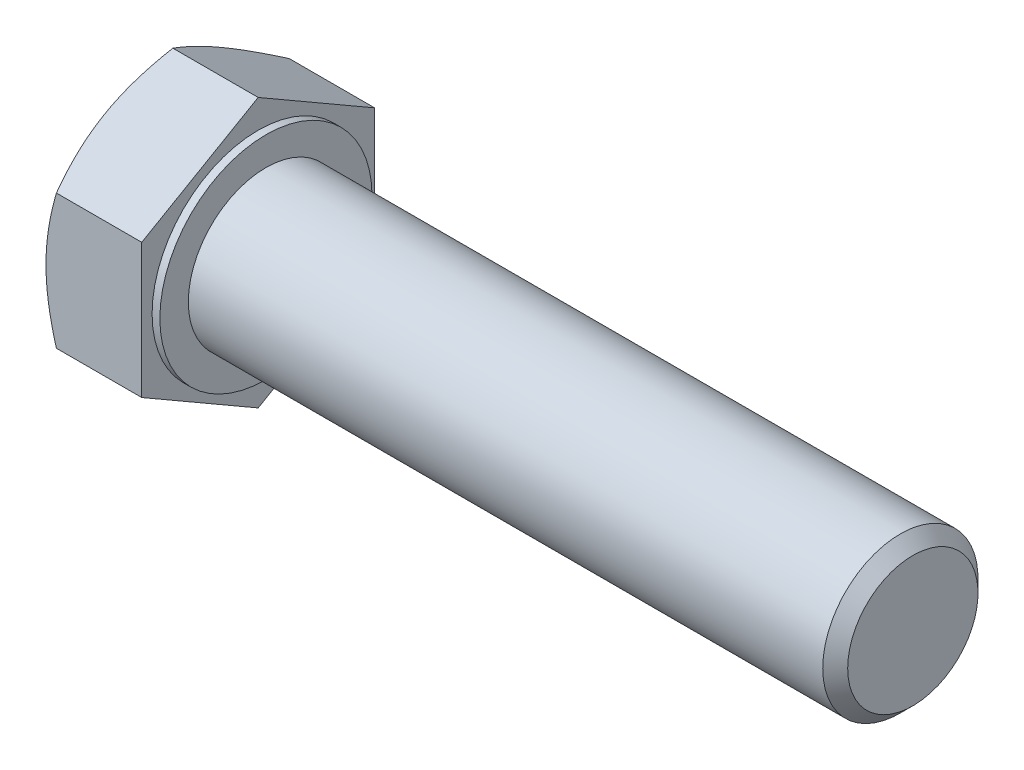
ISO-10303-21;
HEADER;
FILE_DESCRIPTION(('STEP AP214'),'2;1');
FILE_NAME('part.step','',(''),(''),'','','');
FILE_SCHEMA(('AUTOMOTIVE_DESIGN { 1 0 10303 214 1 1 1 1 }'));
ENDSEC;
DATA;
#1=APPLICATION_CONTEXT('core data for automotive mechanical design processes');
#2=APPLICATION_PROTOCOL_DEFINITION('international standard','automotive_design',2000,#1);
#3=PRODUCT_CONTEXT('',#1,'mechanical');
#4=PRODUCT('Part','Part','',(#3));
#5=PRODUCT_RELATED_PRODUCT_CATEGORY('part','',(#4));
#6=PRODUCT_DEFINITION_FORMATION('','',#4);
#7=PRODUCT_DEFINITION_CONTEXT('part definition',#1,'design');
#8=PRODUCT_DEFINITION('design','',#6,#7);
#9=PRODUCT_DEFINITION_SHAPE('','',#8);
#10=(LENGTH_UNIT() NAMED_UNIT(*) SI_UNIT(.MILLI.,.METRE.));
#11=(NAMED_UNIT(*) PLANE_ANGLE_UNIT() SI_UNIT($,.RADIAN.));
#12=(NAMED_UNIT(*) SI_UNIT($,.STERADIAN.) SOLID_ANGLE_UNIT());
#13=UNCERTAINTY_MEASURE_WITH_UNIT(LENGTH_MEASURE(1.E-05),#10,'distance_accuracy_value','');
#14=(GEOMETRIC_REPRESENTATION_CONTEXT(3) GLOBAL_UNCERTAINTY_ASSIGNED_CONTEXT((#13)) GLOBAL_UNIT_ASSIGNED_CONTEXT((#10,
#11,#12)) REPRESENTATION_CONTEXT('',''));
#15=CARTESIAN_POINT('',(0.,0.,0.));
#16=DIRECTION('',(0.,0.,1.));
#17=DIRECTION('',(1.,0.,0.));
#18=AXIS2_PLACEMENT_3D('',#15,#16,#17);
#19=CARTESIAN_POINT('',(8.,10.3923048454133,0.));
#20=DIRECTION('',(1.,0.,0.));
#21=DIRECTION('',(0.,0.,-1.));
#22=AXIS2_PLACEMENT_3D('',#19,#20,#21);
#23=PLANE('',#22);
#24=CARTESIAN_POINT('',(8.,0.,0.));
#25=DIRECTION('',(1.,0.,0.));
#26=DIRECTION('',(0.,0.,-1.));
#27=AXIS2_PLACEMENT_3D('',#24,#25,#26);
#28=CIRCLE('',#27,6.);
#29=CARTESIAN_POINT('',(8.,0.,-6.));
#30=VERTEX_POINT('',#29);
#31=EDGE_CURVE('E251',#30,#30,#28,.F.);
#32=ORIENTED_EDGE('',*,*,#31,.T.);
#33=EDGE_LOOP('',(#32));
#34=FACE_BOUND('',#33,.T.);
#35=CARTESIAN_POINT('',(8.,0.,0.));
#36=DIRECTION('',(-1.,0.,0.));
#37=DIRECTION('',(0.,0.,1.));
#38=AXIS2_PLACEMENT_3D('',#35,#36,#37);
#39=CIRCLE('',#38,8.2);
#40=CARTESIAN_POINT('',(8.,0.,8.2));
#41=VERTEX_POINT('',#40);
#42=EDGE_CURVE('E275',#41,#41,#39,.T.);
#43=ORIENTED_EDGE('',*,*,#42,.F.);
#44=EDGE_LOOP('',(#43));
#45=FACE_BOUND('',#44,.T.);
#46=ADVANCED_FACE('F32',(#34,#45),#23,.T.);
#47=CARTESIAN_POINT('',(0.,0.,0.));
#48=DIRECTION('',(-1.,0.,0.));
#49=DIRECTION('',(0.,0.,1.));
#50=AXIS2_PLACEMENT_3D('',#47,#48,#49);
#51=CYLINDRICAL_SURFACE('',#50,6.);
#52=ORIENTED_EDGE('',*,*,#31,.F.);
#53=EDGE_LOOP('',(#52));
#54=FACE_BOUND('',#53,.T.);
#55=CARTESIAN_POINT('',(57.036,0.,0.));
#56=DIRECTION('',(-1.,0.,0.));
#57=DIRECTION('',(0.,0.,1.));
#58=AXIS2_PLACEMENT_3D('',#55,#56,#57);
#59=CIRCLE('',#58,6.);
#60=CARTESIAN_POINT('',(57.036,0.,6.));
#61=VERTEX_POINT('',#60);
#62=EDGE_CURVE('E246',#61,#61,#59,.T.);
#63=ORIENTED_EDGE('',*,*,#62,.T.);
#64=EDGE_LOOP('',(#63));
#65=FACE_BOUND('',#64,.T.);
#66=ADVANCED_FACE('F232',(#54,#65),#51,.T.);
#67=CARTESIAN_POINT('',(58.,0.,0.));
#68=DIRECTION('',(-1.,0.,0.));
#69=DIRECTION('',(0.,0.,1.));
#70=AXIS2_PLACEMENT_3D('',#67,#68,#69);
#71=CONICAL_SURFACE('',#70,5.036,0.785398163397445);
#72=ORIENTED_EDGE('',*,*,#62,.F.);
#73=EDGE_LOOP('',(#72));
#74=FACE_BOUND('',#73,.T.);
#75=CARTESIAN_POINT('',(58.,0.,0.));
#76=DIRECTION('',(-1.,0.,0.));
#77=DIRECTION('',(0.,0.,1.));
#78=AXIS2_PLACEMENT_3D('',#75,#76,#77);
#79=CIRCLE('',#78,5.036);
#80=CARTESIAN_POINT('',(58.,0.,5.036));
#81=VERTEX_POINT('',#80);
#82=EDGE_CURVE('E249',#81,#81,#79,.T.);
#83=ORIENTED_EDGE('',*,*,#82,.T.);
#84=EDGE_LOOP('',(#83));
#85=FACE_BOUND('',#84,.T.);
#86=ADVANCED_FACE('F235',(#74,#85),#71,.T.);
#87=CARTESIAN_POINT('',(58.,0.,0.));
#88=DIRECTION('',(-1.,0.,0.));
#89=DIRECTION('',(0.,0.,1.));
#90=AXIS2_PLACEMENT_3D('',#87,#88,#89);
#91=PLANE('',#90);
#92=ORIENTED_EDGE('',*,*,#82,.F.);
#93=EDGE_LOOP('',(#92));
#94=FACE_BOUND('',#93,.T.);
#95=ADVANCED_FACE('F200',(#94),#91,.F.);
#96=CARTESIAN_POINT('',(7.4,8.2,0.));
#97=DIRECTION('',(1.,0.,0.));
#98=DIRECTION('',(0.,0.,-1.));
#99=AXIS2_PLACEMENT_3D('',#96,#97,#98);
#100=PLANE('',#99);
#101=CARTESIAN_POINT('',(7.4,0.,0.));
#102=DIRECTION('',(-1.,0.,0.));
#103=DIRECTION('',(0.,0.,1.));
#104=AXIS2_PLACEMENT_3D('',#101,#102,#103);
#105=CIRCLE('',#104,8.2);
#106=CARTESIAN_POINT('',(7.4,0.,8.2));
#107=VERTEX_POINT('',#106);
#108=EDGE_CURVE('E272',#107,#107,#105,.T.);
#109=ORIENTED_EDGE('',*,*,#108,.T.);
#110=EDGE_LOOP('',(#109));
#111=FACE_BOUND('',#110,.T.);
#112=DIRECTION('',(0.,0.500000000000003,0.866025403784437));
#113=VECTOR('',#112,1.);
#114=CARTESIAN_POINT('',(7.4,5.19615242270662,-9.));
#115=LINE('',#114,#113);
#116=CARTESIAN_POINT('',(7.4,5.19615242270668,-9.));
#117=VERTEX_POINT('',#116);
#118=CARTESIAN_POINT('',(7.4,10.3923048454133,0.));
#119=VERTEX_POINT('',#118);
#120=EDGE_CURVE('E109',#117,#119,#115,.T.);
#121=ORIENTED_EDGE('',*,*,#120,.T.);
#122=DIRECTION('',(0.,-0.500000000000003,0.866025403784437));
#123=VECTOR('',#122,1.);
#124=CARTESIAN_POINT('',(7.4,10.3923048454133,0.));
#125=LINE('',#124,#123);
#126=CARTESIAN_POINT('',(7.4,5.19615242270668,9.));
#127=VERTEX_POINT('',#126);
#128=EDGE_CURVE('E103',#119,#127,#125,.T.);
#129=ORIENTED_EDGE('',*,*,#128,.T.);
#130=DIRECTION('',(0.,-1.,0.));
#131=VECTOR('',#130,1.);
#132=CARTESIAN_POINT('',(7.4,5.19615242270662,9.));
#133=LINE('',#132,#131);
#134=CARTESIAN_POINT('',(7.4,-5.19615242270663,9.00000000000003));
#135=VERTEX_POINT('',#134);
#136=EDGE_CURVE('E106',#127,#135,#133,.T.);
#137=ORIENTED_EDGE('',*,*,#136,.T.);
#138=DIRECTION('',(0.,-0.500000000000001,-0.866025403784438));
#139=VECTOR('',#138,1.);
#140=CARTESIAN_POINT('',(7.4,-10.3923048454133,0.));
#141=LINE('',#140,#139);
#142=CARTESIAN_POINT('',(7.4,-10.3923048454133,0.));
#143=VERTEX_POINT('',#142);
#144=EDGE_CURVE('E122',#135,#143,#141,.T.);
#145=ORIENTED_EDGE('',*,*,#144,.T.);
#146=DIRECTION('',(0.,0.500000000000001,-0.866025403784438));
#147=VECTOR('',#146,1.);
#148=CARTESIAN_POINT('',(7.4,-5.19615242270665,-9.));
#149=LINE('',#148,#147);
#150=CARTESIAN_POINT('',(7.4,-5.19615242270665,-9.));
#151=VERTEX_POINT('',#150);
#152=EDGE_CURVE('E47',#143,#151,#149,.T.);
#153=ORIENTED_EDGE('',*,*,#152,.T.);
#154=DIRECTION('',(0.,1.,0.));
#155=VECTOR('',#154,1.);
#156=CARTESIAN_POINT('',(7.4,5.19615242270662,-9.));
#157=LINE('',#156,#155);
#158=EDGE_CURVE('E11',#151,#117,#157,.T.);
#159=ORIENTED_EDGE('',*,*,#158,.T.);
#160=EDGE_LOOP('',(#121,#129,#137,#145,#153,#159));
#161=FACE_BOUND('',#160,.T.);
#162=ADVANCED_FACE('F105',(#111,#161),#100,.T.);
#163=CARTESIAN_POINT('',(0.,0.,0.));
#164=DIRECTION('',(-1.,0.,0.));
#165=DIRECTION('',(0.,0.,1.));
#166=AXIS2_PLACEMENT_3D('',#163,#164,#165);
#167=CYLINDRICAL_SURFACE('',#166,8.2);
#168=ORIENTED_EDGE('',*,*,#42,.T.);
#169=EDGE_LOOP('',(#168));
#170=FACE_BOUND('',#169,.T.);
#171=ORIENTED_EDGE('',*,*,#108,.F.);
#172=EDGE_LOOP('',(#171));
#173=FACE_BOUND('',#172,.T.);
#174=ADVANCED_FACE('F229',(#170,#173),#167,.T.);
#175=CARTESIAN_POINT('',(0.,10.3923048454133,0.));
#176=DIRECTION('',(1.,0.,0.));
#177=DIRECTION('',(0.,0.,-1.));
#178=AXIS2_PLACEMENT_3D('',#175,#176,#177);
#179=PLANE('',#178);
#180=CARTESIAN_POINT('',(0.,0.,0.));
#181=DIRECTION('',(1.,0.,0.));
#182=DIRECTION('',(0.,0.,-1.));
#183=AXIS2_PLACEMENT_3D('',#180,#181,#182);
#184=CIRCLE('',#183,9.);
#185=CARTESIAN_POINT('',(0.,0.,-9.));
#186=VERTEX_POINT('',#185);
#187=CARTESIAN_POINT('',(0.,7.79422863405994,-4.50000000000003));
#188=VERTEX_POINT('',#187);
#189=EDGE_CURVE('E41',#186,#188,#184,.T.);
#190=ORIENTED_EDGE('',*,*,#189,.F.);
#191=CARTESIAN_POINT('',(0.,-7.79422863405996,-4.50000000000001));
#192=VERTEX_POINT('',#191);
#193=EDGE_CURVE('E130',#192,#186,#184,.T.);
#194=ORIENTED_EDGE('',*,*,#193,.F.);
#195=CARTESIAN_POINT('',(0.,-7.79422863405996,4.50000000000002));
#196=VERTEX_POINT('',#195);
#197=EDGE_CURVE('E136',#196,#192,#184,.T.);
#198=ORIENTED_EDGE('',*,*,#197,.F.);
#199=CARTESIAN_POINT('',(0.,0.,9.));
#200=VERTEX_POINT('',#199);
#201=EDGE_CURVE('E142',#200,#196,#184,.T.);
#202=ORIENTED_EDGE('',*,*,#201,.F.);
#203=CARTESIAN_POINT('',(0.,7.79422863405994,4.50000000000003));
#204=VERTEX_POINT('',#203);
#205=EDGE_CURVE('E147',#204,#200,#184,.T.);
#206=ORIENTED_EDGE('',*,*,#205,.F.);
#207=EDGE_CURVE('E143',#188,#204,#184,.T.);
#208=ORIENTED_EDGE('',*,*,#207,.F.);
#209=EDGE_LOOP('',(#190,#194,#198,#202,#206,#208));
#210=FACE_BOUND('',#209,.T.);
#211=ADVANCED_FACE('F161',(#210),#179,.F.);
#212=CARTESIAN_POINT('',(-2.25,0.,0.));
#213=DIRECTION('',(1.,0.,0.));
#214=DIRECTION('',(0.,0.,-1.));
#215=AXIS2_PLACEMENT_3D('',#212,#213,#214);
#216=CONICAL_SURFACE('',#215,5.10288568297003,1.0471975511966);
#217=CARTESIAN_POINT('',(0.803914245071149,10.3924203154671,0.000199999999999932));
#218=CARTESIAN_POINT('',(0.737982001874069,10.2782163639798,-0.197607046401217));
#219=CARTESIAN_POINT('',(0.675041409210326,10.1635669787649,-0.396185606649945));
#220=CARTESIAN_POINT('',(0.55596899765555,9.93333715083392,-0.79495536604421));
#221=CARTESIAN_POINT('',(0.499840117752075,9.81775632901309,-0.995147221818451));
#222=CARTESIAN_POINT('',(0.395151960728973,9.5854491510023,-1.3975150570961));
#223=CARTESIAN_POINT('',(0.346610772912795,9.46872074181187,-1.5996945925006));
#224=CARTESIAN_POINT('',(0.258148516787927,9.23447001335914,-2.00542875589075));
#225=CARTESIAN_POINT('',(0.21822568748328,9.11694786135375,-2.20898309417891));
#226=CARTESIAN_POINT('',(0.14868467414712,8.88408932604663,-2.61230590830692));
#227=CARTESIAN_POINT('',(0.118837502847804,8.76877014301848,-2.81204459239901));
#228=CARTESIAN_POINT('',(0.0687933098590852,8.53761579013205,-3.212415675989));
#229=CARTESIAN_POINT('',(0.0485954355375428,8.42178066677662,-3.41304799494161));
#230=CARTESIAN_POINT('',(0.0183543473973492,8.18990950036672,-3.81466063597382));
#231=CARTESIAN_POINT('',(0.00829960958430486,8.07387383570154,-4.01564030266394));
#232=CARTESIAN_POINT('',(-0.0014376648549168,7.84169571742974,-4.41778459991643));
#233=CARTESIAN_POINT('',(-0.0011205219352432,7.72555326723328,-4.61894922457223));
#234=CARTESIAN_POINT('',(0.00916395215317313,7.50842142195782,-4.99503261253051));
#235=CARTESIAN_POINT('',(0.0178767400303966,7.40741671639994,-5.1699778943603));
#236=CARTESIAN_POINT('',(0.0429773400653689,7.20564389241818,-5.51945867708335));
#237=CARTESIAN_POINT('',(0.0593656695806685,7.10487579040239,-5.69399414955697));
#238=CARTESIAN_POINT('',(0.119656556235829,6.80296159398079,-6.21692487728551));
#239=CARTESIAN_POINT('',(0.174677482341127,6.60234990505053,-6.56439451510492));
#240=CARTESIAN_POINT('',(0.312230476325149,6.1989985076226,-7.263019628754));
#241=CARTESIAN_POINT('',(0.395345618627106,5.99631027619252,-7.61408594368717));
#242=CARTESIAN_POINT('',(0.583982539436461,5.59395639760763,-8.31098330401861));
#243=CARTESIAN_POINT('',(0.689460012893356,5.39428559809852,-8.65682327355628));
#244=CARTESIAN_POINT('',(0.80391424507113,5.19603695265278,-9.0002));
#245=B_SPLINE_CURVE_WITH_KNOTS('',3,(#217,#218,#219,#220,#221,#222,#223,#224,#225,#226,#227,
#228,#229,#230,#231,#232,#233,#234,#235,#236,#237,#238,#239,#240,#241,#242,#243,#244),
.UNSPECIFIED.,.F.,.F.,(4,2,2,2,2,2,2,2,2,2,2,2,2,4),(0.,0.71321924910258,1.42674513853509,
2.14194697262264,2.85700253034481,3.55449749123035,4.25193080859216,4.94857085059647,
5.64518936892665,6.25162976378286,6.85811104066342,8.07193747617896,9.31268391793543,
10.5509947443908),.UNSPECIFIED.);
#246=CARTESIAN_POINT('',(0.803847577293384,10.3923048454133,0.));
#247=VERTEX_POINT('',#246);
#248=EDGE_CURVE('E55',#247,#188,#245,.T.);
#249=ORIENTED_EDGE('',*,*,#248,.T.);
#250=ORIENTED_EDGE('',*,*,#207,.T.);
#251=CARTESIAN_POINT('',(0.80391424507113,5.19603695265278,9.0002));
#252=CARTESIAN_POINT('',(0.737982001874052,5.31024090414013,8.80239295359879));
#253=CARTESIAN_POINT('',(0.67504140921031,5.42489028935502,8.60381439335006));
#254=CARTESIAN_POINT('',(0.555968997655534,5.65512011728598,8.20504463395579));
#255=CARTESIAN_POINT('',(0.499840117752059,5.77070093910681,8.00485277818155));
#256=CARTESIAN_POINT('',(0.395151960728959,6.00300811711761,7.6024849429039));
#257=CARTESIAN_POINT('',(0.346610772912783,6.11973652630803,7.40030540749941));
#258=CARTESIAN_POINT('',(0.258148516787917,6.35398725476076,6.99457124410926));
#259=CARTESIAN_POINT('',(0.218225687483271,6.47150940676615,6.79101690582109));
#260=CARTESIAN_POINT('',(0.148684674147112,6.70436794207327,6.38769409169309));
#261=CARTESIAN_POINT('',(0.118837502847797,6.81968712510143,6.187955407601));
#262=CARTESIAN_POINT('',(0.0687933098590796,7.05084147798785,5.78758432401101));
#263=CARTESIAN_POINT('',(0.0485954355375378,7.16667660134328,5.5869520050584));
#264=CARTESIAN_POINT('',(0.018354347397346,7.39854776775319,5.18533936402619));
#265=CARTESIAN_POINT('',(0.00829960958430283,7.51458343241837,4.98435969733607));
#266=CARTESIAN_POINT('',(-0.00143766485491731,7.74676155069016,4.58221540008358));
#267=CARTESIAN_POINT('',(-0.00112052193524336,7.86290400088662,4.38105077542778));
#268=CARTESIAN_POINT('',(0.00916395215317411,8.08003584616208,4.00496738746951));
#269=CARTESIAN_POINT('',(0.0178767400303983,8.18104055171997,3.83002210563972));
#270=CARTESIAN_POINT('',(0.0429773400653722,8.38281337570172,3.48054132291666));
#271=CARTESIAN_POINT('',(0.0593656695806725,8.48358147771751,3.30600585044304));
#272=CARTESIAN_POINT('',(0.119656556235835,8.78549567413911,2.7830751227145));
#273=CARTESIAN_POINT('',(0.174677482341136,8.98610736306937,2.43560548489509));
#274=CARTESIAN_POINT('',(0.312230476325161,9.38945876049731,1.736980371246));
#275=CARTESIAN_POINT('',(0.395345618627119,9.59214699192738,1.38591405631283));
#276=CARTESIAN_POINT('',(0.583982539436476,9.99450087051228,0.689016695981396));
#277=CARTESIAN_POINT('',(0.689460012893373,10.1941716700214,0.343176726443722));
#278=CARTESIAN_POINT('',(0.803914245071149,10.3924203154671,-0.00020000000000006));
#279=B_SPLINE_CURVE_WITH_KNOTS('',3,(#251,#252,#253,#254,#255,#256,#257,#258,#259,#260,#261,
#262,#263,#264,#265,#266,#267,#268,#269,#270,#271,#272,#273,#274,#275,#276,#277,#278),
.UNSPECIFIED.,.F.,.F.,(4,2,2,2,2,2,2,2,2,2,2,2,2,4),(0.,0.713219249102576,1.42674513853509,
2.14194697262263,2.85700253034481,3.55449749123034,4.25193080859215,4.94857085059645,
5.64518936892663,6.25162976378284,6.85811104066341,8.07193747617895,9.31268391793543,
10.5509947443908),.UNSPECIFIED.);
#280=EDGE_CURVE('E253',#204,#247,#279,.T.);
#281=ORIENTED_EDGE('',*,*,#280,.T.);
#282=EDGE_LOOP('',(#249,#250,#281));
#283=FACE_BOUND('',#282,.T.);
#284=ADVANCED_FACE('F192',(#283),#216,.T.);
#285=CARTESIAN_POINT('',(0.803847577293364,5.19615242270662,9.));
#286=VERTEX_POINT('',#285);
#287=EDGE_CURVE('E127',#286,#204,#279,.T.);
#288=ORIENTED_EDGE('',*,*,#287,.T.);
#289=ORIENTED_EDGE('',*,*,#205,.T.);
#290=CARTESIAN_POINT('',(4.40440242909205,-13.9825591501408,9.));
#291=CARTESIAN_POINT('',(4.21352027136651,-13.589267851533,9.));
#292=CARTESIAN_POINT('',(4.02446108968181,-13.1950764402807,9.));
#293=CARTESIAN_POINT('',(3.65101341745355,-12.4044148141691,9.));
#294=CARTESIAN_POINT('',(3.46662565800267,-12.0079442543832,9.));
#295=CARTESIAN_POINT('',(3.10262324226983,-11.2102149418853,9.));
#296=CARTESIAN_POINT('',(2.92303981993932,-10.8089418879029,9.));
#297=CARTESIAN_POINT('',(2.57118838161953,-10.0032131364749,9.));
#298=CARTESIAN_POINT('',(2.39892002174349,-9.5987575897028,9.));
#299=CARTESIAN_POINT('',(2.05819589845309,-8.77285037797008,9.));
#300=CARTESIAN_POINT('',(1.89004433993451,-8.35127251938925,9.));
#301=CARTESIAN_POINT('',(1.56640690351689,-7.50319485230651,9.));
#302=CARTESIAN_POINT('',(1.41092244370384,-7.07669449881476,9.));
#303=CARTESIAN_POINT('',(1.11668317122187,-6.21887842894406,9.));
#304=CARTESIAN_POINT('',(0.977894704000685,-5.78757438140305,9.));
#305=CARTESIAN_POINT('',(0.721482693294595,-4.91879467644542,9.));
#306=CARTESIAN_POINT('',(0.603852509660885,-4.48132100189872,9.));
#307=CARTESIAN_POINT('',(0.396022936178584,-3.60232451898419,9.));
#308=CARTESIAN_POINT('',(0.305673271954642,-3.16083822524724,9.));
#309=CARTESIAN_POINT('',(0.194505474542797,-2.49456832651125,9.));
#310=CARTESIAN_POINT('',(0.161507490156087,-2.27178873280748,9.));
#311=CARTESIAN_POINT('',(0.104277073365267,-1.82511370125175,9.));
#312=CARTESIAN_POINT('',(0.0800437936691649,-1.60121837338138,9.));
#313=CARTESIAN_POINT('',(0.0411307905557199,-1.15554740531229,9.));
#314=CARTESIAN_POINT('',(0.0263302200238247,-0.933782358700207,9.));
#315=CARTESIAN_POINT('',(0.00612165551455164,-0.48982505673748,9.));
#316=CARTESIAN_POINT('',(0.000713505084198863,-0.267632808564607,9.));
#317=CARTESIAN_POINT('',(-0.000581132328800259,0.176781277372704,9.));
#318=CARTESIAN_POINT('',(0.00353239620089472,0.399003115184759,9.));
#319=CARTESIAN_POINT('',(0.0211802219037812,0.843075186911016,9.));
#320=CARTESIAN_POINT('',(0.0347149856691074,1.06492540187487,9.));
#321=CARTESIAN_POINT('',(0.0782159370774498,1.59735185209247,9.));
#322=CARTESIAN_POINT('',(0.112610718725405,1.90757395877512,9.));
#323=CARTESIAN_POINT('',(0.197951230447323,2.52571747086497,9.));
#324=CARTESIAN_POINT('',(0.248899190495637,2.83363856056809,9.));
#325=CARTESIAN_POINT('',(0.423871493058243,3.75359836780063,9.));
#326=CARTESIAN_POINT('',(0.569992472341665,4.36149011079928,9.));
#327=CARTESIAN_POINT('',(0.823402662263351,5.27045401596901,9.));
#328=CARTESIAN_POINT('',(0.91475427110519,5.5762406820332,9.));
#329=CARTESIAN_POINT('',(1.1069533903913,6.18484428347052,9.));
#330=CARTESIAN_POINT('',(1.20780096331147,6.48766119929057,9.));
#331=CARTESIAN_POINT('',(1.41737334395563,7.09042005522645,9.));
#332=CARTESIAN_POINT('',(1.52609555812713,7.39036290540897,9.));
#333=CARTESIAN_POINT('',(1.75013726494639,7.98776331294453,9.));
#334=CARTESIAN_POINT('',(1.86545668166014,8.28522089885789,9.));
#335=CARTESIAN_POINT('',(2.14416312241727,8.98476295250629,9.));
#336=CARTESIAN_POINT('',(2.30989301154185,9.38591223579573,9.));
#337=CARTESIAN_POINT('',(2.64938307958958,10.1848085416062,9.));
#338=CARTESIAN_POINT('',(2.82314374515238,10.5825553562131,9.));
#339=CARTESIAN_POINT('',(3.17709432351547,11.3752767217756,9.));
#340=CARTESIAN_POINT('',(3.35728566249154,11.7702506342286,9.));
#341=CARTESIAN_POINT('',(3.72280622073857,12.557797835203,9.));
#342=CARTESIAN_POINT('',(3.9081353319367,12.9503711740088,9.));
#343=CARTESIAN_POINT('',(4.28317774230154,13.7339419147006,9.));
#344=CARTESIAN_POINT('',(4.47289561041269,14.1249371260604,9.));
#345=CARTESIAN_POINT('',(4.85577768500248,14.9052357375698,9.));
#346=CARTESIAN_POINT('',(5.04894190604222,15.2945391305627,9.));
#347=CARTESIAN_POINT('',(5.63264129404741,16.4602147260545,9.));
#348=CARTESIAN_POINT('',(6.02743288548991,17.2344553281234,9.));
#349=CARTESIAN_POINT('',(6.79169790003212,18.7143023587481,9.));
#350=CARTESIAN_POINT('',(7.16053205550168,19.4202404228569,9.));
#351=CARTESIAN_POINT('',(7.90326698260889,20.8294760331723,9.));
#352=CARTESIAN_POINT('',(8.27716793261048,21.5327734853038,9.));
#353=CARTESIAN_POINT('',(9.02789155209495,22.9355520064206,9.));
#354=CARTESIAN_POINT('',(9.40470462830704,23.6350382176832,9.));
#355=CARTESIAN_POINT('',(10.1613606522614,25.0323206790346,9.));
#356=CARTESIAN_POINT('',(10.5412034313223,25.7301170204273,9.));
#357=CARTESIAN_POINT('',(10.922177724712,26.427290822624,9.));
#358=B_SPLINE_CURVE_WITH_KNOTS('',3,(#290,#291,#292,#293,#294,#295,#296,#297,#298,#299,#300,
#301,#302,#303,#304,#305,#306,#307,#308,#309,#310,#311,#312,#313,#314,#315,#316,#317,#318,#319,
#320,#321,#322,#323,#324,#325,#326,#327,#328,#329,#330,#331,#332,#333,#334,#335,#336,#337,#338,
#339,#340,#341,#342,#343,#344,#345,#346,#347,#348,#349,#350,#351,#352,#353,#354,#355,#356,#357),
.UNSPECIFIED.,.F.,.F.,(4,2,2,2,2,2,2,2,2,2,2,2,2,2,2,2,2,2,2,2,2,2,2,2,2,2,2,2,2,2,2,2,2,4),(0.,
1.31151365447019,2.62323131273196,3.94204822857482,5.2608030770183,6.62227116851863,
7.98389146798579,9.34271941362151,10.7011201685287,12.0518956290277,12.7273808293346,
13.402800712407,14.0693836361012,14.7359554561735,15.402528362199,16.0691342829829,
17.0049748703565,17.9409415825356,19.8139052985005,20.7712463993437,21.7285937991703,
22.6856273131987,23.6426498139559,24.9446398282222,26.2467088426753,27.5490684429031,
28.8514006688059,30.1551558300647,31.458916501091,34.0660948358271,36.4555257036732,
38.8450409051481,41.2286062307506,43.6120397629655),.UNSPECIFIED.);
#359=EDGE_CURVE('E171',#200,#286,#358,.T.);
#360=ORIENTED_EDGE('',*,*,#359,.T.);
#361=EDGE_LOOP('',(#288,#289,#360));
#362=FACE_BOUND('',#361,.T.);
#363=ADVANCED_FACE('F197',(#362),#216,.T.);
#364=CARTESIAN_POINT('',(0.803847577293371,-5.19615242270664,9.));
#365=VERTEX_POINT('',#364);
#366=EDGE_CURVE('E159',#365,#200,#358,.T.);
#367=ORIENTED_EDGE('',*,*,#366,.T.);
#368=ORIENTED_EDGE('',*,*,#201,.T.);
#369=CARTESIAN_POINT('',(0.803914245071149,-10.3924203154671,-0.000200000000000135));
#370=CARTESIAN_POINT('',(0.73798200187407,-10.2782163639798,0.197607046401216));
#371=CARTESIAN_POINT('',(0.675041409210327,-10.1635669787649,0.396185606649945));
#372=CARTESIAN_POINT('',(0.555968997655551,-9.93333715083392,0.794955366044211));
#373=CARTESIAN_POINT('',(0.499840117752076,-9.8177563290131,0.995147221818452));
#374=CARTESIAN_POINT('',(0.395151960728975,-9.5854491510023,1.3975150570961));
#375=CARTESIAN_POINT('',(0.346610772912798,-9.46872074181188,1.5996945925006));
#376=CARTESIAN_POINT('',(0.25814851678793,-9.23447001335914,2.00542875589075));
#377=CARTESIAN_POINT('',(0.218225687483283,-9.11694786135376,2.20898309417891));
#378=CARTESIAN_POINT('',(0.148684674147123,-8.88408932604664,2.61230590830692));
#379=CARTESIAN_POINT('',(0.118837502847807,-8.76877014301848,2.81204459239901));
#380=CARTESIAN_POINT('',(0.0687933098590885,-8.53761579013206,3.212415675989));
#381=CARTESIAN_POINT('',(0.0485954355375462,-8.42178066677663,3.41304799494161));
#382=CARTESIAN_POINT('',(0.0183543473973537,-8.18990950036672,3.81466063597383));
#383=CARTESIAN_POINT('',(0.00829960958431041,-8.07387383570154,4.01564030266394));
#384=CARTESIAN_POINT('',(-0.00143766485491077,-7.84169571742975,4.41778459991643));
#385=CARTESIAN_POINT('',(-0.00112052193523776,-7.72555326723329,4.61894922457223));
#386=CARTESIAN_POINT('',(0.00916395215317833,-7.50842142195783,4.99503261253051));
#387=CARTESIAN_POINT('',(0.017876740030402,-7.40741671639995,5.1699778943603));
#388=CARTESIAN_POINT('',(0.0429773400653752,-7.20564389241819,5.51945867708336));
#389=CARTESIAN_POINT('',(0.0593656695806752,-7.1048757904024,5.69399414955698));
#390=CARTESIAN_POINT('',(0.119656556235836,-6.80296159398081,6.21692487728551));
#391=CARTESIAN_POINT('',(0.174677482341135,-6.60234990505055,6.56439451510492));
#392=CARTESIAN_POINT('',(0.312230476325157,-6.19899850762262,7.263019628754));
#393=CARTESIAN_POINT('',(0.395345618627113,-5.99631027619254,7.61408594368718));
#394=CARTESIAN_POINT('',(0.583982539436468,-5.59395639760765,8.31098330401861));
#395=CARTESIAN_POINT('',(0.689460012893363,-5.39428559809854,8.65682327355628));
#396=CARTESIAN_POINT('',(0.803914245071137,-5.1960369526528,9.0002));
#397=B_SPLINE_CURVE_WITH_KNOTS('',3,(#369,#370,#371,#372,#373,#374,#375,#376,#377,#378,#379,
#380,#381,#382,#383,#384,#385,#386,#387,#388,#389,#390,#391,#392,#393,#394,#395,#396),
.UNSPECIFIED.,.F.,.F.,(4,2,2,2,2,2,2,2,2,2,2,2,2,4),(0.,0.71321924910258,1.42674513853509,
2.14194697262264,2.85700253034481,3.55449749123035,4.25193080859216,4.94857085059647,
5.64518936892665,6.25162976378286,6.85811104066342,8.07193747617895,9.31268391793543,
10.5509947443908),.UNSPECIFIED.);
#398=EDGE_CURVE('E158',#196,#365,#397,.T.);
#399=ORIENTED_EDGE('',*,*,#398,.T.);
#400=EDGE_LOOP('',(#367,#368,#399));
#401=FACE_BOUND('',#400,.T.);
#402=ADVANCED_FACE('F156',(#401),#216,.T.);
#403=CARTESIAN_POINT('',(0.803847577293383,-10.3923048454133,0.));
#404=VERTEX_POINT('',#403);
#405=EDGE_CURVE('E169',#404,#196,#397,.T.);
#406=ORIENTED_EDGE('',*,*,#405,.T.);
#407=ORIENTED_EDGE('',*,*,#197,.T.);
#408=CARTESIAN_POINT('',(0.80391424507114,-5.19603695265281,-9.0002));
#409=CARTESIAN_POINT('',(0.737982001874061,-5.31024090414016,-8.80239295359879));
#410=CARTESIAN_POINT('',(0.675041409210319,-5.42489028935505,-8.60381439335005));
#411=CARTESIAN_POINT('',(0.555968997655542,-5.65512011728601,-8.20504463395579));
#412=CARTESIAN_POINT('',(0.499840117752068,-5.77070093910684,-8.00485277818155));
#413=CARTESIAN_POINT('',(0.395151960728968,-6.00300811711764,-7.6024849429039));
#414=CARTESIAN_POINT('',(0.346610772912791,-6.11973652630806,-7.4003054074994));
#415=CARTESIAN_POINT('',(0.258148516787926,-6.35398725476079,-6.99457124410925));
#416=CARTESIAN_POINT('',(0.218225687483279,-6.47150940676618,-6.79101690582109));
#417=CARTESIAN_POINT('',(0.14868467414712,-6.7043679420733,-6.38769409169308));
#418=CARTESIAN_POINT('',(0.118837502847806,-6.81968712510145,-6.18795540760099));
#419=CARTESIAN_POINT('',(0.0687933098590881,-7.05084147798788,-5.787584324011));
#420=CARTESIAN_POINT('',(0.0485954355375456,-7.1666766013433,-5.58695200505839));
#421=CARTESIAN_POINT('',(0.0183543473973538,-7.39854776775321,-5.18533936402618));
#422=CARTESIAN_POINT('',(0.00829960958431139,-7.51458343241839,-4.98435969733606));
#423=CARTESIAN_POINT('',(-0.00143766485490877,-7.74676155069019,-4.58221540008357));
#424=CARTESIAN_POINT('',(-0.00112052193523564,-7.86290400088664,-4.38105077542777));
#425=CARTESIAN_POINT('',(0.00916395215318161,-8.0800358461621,-4.00496738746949));
#426=CARTESIAN_POINT('',(0.0178767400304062,-8.18104055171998,-3.8300221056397));
#427=CARTESIAN_POINT('',(0.0429773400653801,-8.38281337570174,-3.48054132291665));
#428=CARTESIAN_POINT('',(0.0593656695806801,-8.48358147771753,-3.30600585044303));
#429=CARTESIAN_POINT('',(0.119656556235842,-8.78549567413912,-2.78307512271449));
#430=CARTESIAN_POINT('',(0.174677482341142,-8.98610736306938,-2.43560548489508));
#431=CARTESIAN_POINT('',(0.312230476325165,-9.38945876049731,-1.736980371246));
#432=CARTESIAN_POINT('',(0.395345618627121,-9.59214699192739,-1.38591405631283));
#433=CARTESIAN_POINT('',(0.583982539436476,-9.99450087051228,-0.689016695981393));
#434=CARTESIAN_POINT('',(0.689460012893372,-10.1941716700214,-0.343176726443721));
#435=CARTESIAN_POINT('',(0.803914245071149,-10.3924203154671,0.000199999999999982));
#436=B_SPLINE_CURVE_WITH_KNOTS('',3,(#408,#409,#410,#411,#412,#413,#414,#415,#416,#417,#418,
#419,#420,#421,#422,#423,#424,#425,#426,#427,#428,#429,#430,#431,#432,#433,#434,#435),
.UNSPECIFIED.,.F.,.F.,(4,2,2,2,2,2,2,2,2,2,2,2,2,4),(0.,0.713219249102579,1.42674513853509,
2.14194697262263,2.85700253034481,3.55449749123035,4.25193080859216,4.94857085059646,
5.64518936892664,6.25162976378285,6.85811104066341,8.07193747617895,9.31268391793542,
10.5509947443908),.UNSPECIFIED.);
#437=EDGE_CURVE('E173',#192,#404,#436,.T.);
#438=ORIENTED_EDGE('',*,*,#437,.T.);
#439=EDGE_LOOP('',(#406,#407,#438));
#440=FACE_BOUND('',#439,.T.);
#441=ADVANCED_FACE('F265',(#440),#216,.T.);
#442=CARTESIAN_POINT('',(4.40440242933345,-13.982559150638,-9.00000000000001));
#443=CARTESIAN_POINT('',(4.21352027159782,-13.5892678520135,-9.));
#444=CARTESIAN_POINT('',(4.02446108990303,-13.1950764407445,-9.));
#445=CARTESIAN_POINT('',(3.65101341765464,-12.4044148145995,-9.));
#446=CARTESIAN_POINT('',(3.46662565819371,-12.0079442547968,-9.));
#447=CARTESIAN_POINT('',(3.10262324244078,-11.2102149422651,-9.));
#448=CARTESIAN_POINT('',(2.92303982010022,-10.8089418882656,-9.));
#449=CARTESIAN_POINT('',(2.5711883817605,-10.0032131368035,-9.));
#450=CARTESIAN_POINT('',(2.39892002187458,-9.5987575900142,-9.));
#451=CARTESIAN_POINT('',(2.05819589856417,-8.77285037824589,-9.));
#452=CARTESIAN_POINT('',(1.89004434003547,-8.35127251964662,-9.));
#453=CARTESIAN_POINT('',(1.56640690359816,-7.50319485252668,-9.));
#454=CARTESIAN_POINT('',(1.41092244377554,-7.07669449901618,-9.));
#455=CARTESIAN_POINT('',(1.11668317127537,-6.21887842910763,-9.));
#456=CARTESIAN_POINT('',(0.977894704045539,-5.78757438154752,-9.));
#457=CARTESIAN_POINT('',(0.721482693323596,-4.91879467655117,-9.));
#458=CARTESIAN_POINT('',(0.603852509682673,-4.48132100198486,-9.));
#459=CARTESIAN_POINT('',(0.39602293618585,-3.60232451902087,-9.));
#460=CARTESIAN_POINT('',(0.305673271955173,-3.16083822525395,-9.));
#461=CARTESIAN_POINT('',(0.194505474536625,-2.49456832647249,-9.));
#462=CARTESIAN_POINT('',(0.161507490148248,-2.27178873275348,-9.));
#463=CARTESIAN_POINT('',(0.104277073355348,-1.82511370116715,-9.));
#464=CARTESIAN_POINT('',(0.0800437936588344,-1.60121837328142,-9.));
#465=CARTESIAN_POINT('',(0.0411307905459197,-1.15554740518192,-9.));
#466=CARTESIAN_POINT('',(0.0263302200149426,-0.933782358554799,-9.));
#467=CARTESIAN_POINT('',(0.00612165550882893,-0.489825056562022,-9.));
#468=CARTESIAN_POINT('',(0.000713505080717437,-0.267632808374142,-9.));
#469=CARTESIAN_POINT('',(-0.000581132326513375,0.176781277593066,-9.));
#470=CARTESIAN_POINT('',(0.00353239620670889,0.399003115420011,-9.));
#471=CARTESIAN_POINT('',(0.021180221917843,0.843075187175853,-9.));
#472=CARTESIAN_POINT('',(0.0347149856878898,1.0649254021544,-9.));
#473=CARTESIAN_POINT('',(0.07821593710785,1.59735185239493,-9.));
#474=CARTESIAN_POINT('',(0.112610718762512,1.90757395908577,-9.));
#475=CARTESIAN_POINT('',(0.197951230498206,2.5257174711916,-9.));
#476=CARTESIAN_POINT('',(0.248899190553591,2.83363856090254,-9.));
#477=CARTESIAN_POINT('',(0.423871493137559,3.75359836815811,-9.));
#478=CARTESIAN_POINT('',(0.569992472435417,4.36149011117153,-9.));
#479=CARTESIAN_POINT('',(0.823402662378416,5.27045401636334,-9.));
#480=CARTESIAN_POINT('',(0.914754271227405,5.57624068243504,-9.));
#481=CARTESIAN_POINT('',(1.10695339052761,6.18484428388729,-9.));
#482=CARTESIAN_POINT('',(1.20780096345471,6.48766119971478,-9.));
#483=CARTESIAN_POINT('',(1.41737334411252,7.09042005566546,-9.));
#484=CARTESIAN_POINT('',(1.52609555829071,7.39036290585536,-9.));
#485=CARTESIAN_POINT('',(1.75013726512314,7.98776331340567,-9.));
#486=CARTESIAN_POINT('',(1.86545668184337,8.28522089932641,-9.));
#487=CARTESIAN_POINT('',(2.14416312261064,8.98476295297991,-9.));
#488=CARTESIAN_POINT('',(2.30989301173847,9.38591223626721,-9.));
#489=CARTESIAN_POINT('',(2.64938307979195,10.1848085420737,-9.));
#490=CARTESIAN_POINT('',(2.82314374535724,10.5825553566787,-9.));
#491=CARTESIAN_POINT('',(3.17709432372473,11.3752767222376,-9.));
#492=CARTESIAN_POINT('',(3.35728566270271,11.7702506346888,-9.));
#493=CARTESIAN_POINT('',(3.72280622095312,12.5577978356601,-9.));
#494=CARTESIAN_POINT('',(3.90813533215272,12.9503711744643,-8.99999999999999));
#495=CARTESIAN_POINT('',(4.28317774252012,13.7339419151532,-8.99999999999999));
#496=CARTESIAN_POINT('',(4.47289561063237,14.1249371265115,-8.99999999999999));
#497=CARTESIAN_POINT('',(4.85577768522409,14.9052357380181,-8.99999999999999));
#498=CARTESIAN_POINT('',(5.04894190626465,15.2945391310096,-8.99999999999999));
#499=CARTESIAN_POINT('',(5.63264129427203,16.4602147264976,-8.99999999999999));
#500=CARTESIAN_POINT('',(6.02743288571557,17.2344553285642,-8.99999999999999));
#501=CARTESIAN_POINT('',(6.79169790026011,18.7143023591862,-8.99999999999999));
#502=CARTESIAN_POINT('',(7.160532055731,19.4202404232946,-8.99999999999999));
#503=CARTESIAN_POINT('',(7.9032669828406,20.8294760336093,-8.99999999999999));
#504=CARTESIAN_POINT('',(8.27716793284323,21.5327734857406,-8.99999999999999));
#505=CARTESIAN_POINT('',(9.02789155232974,22.9355520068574,-8.99999999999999));
#506=CARTESIAN_POINT('',(9.40470462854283,23.6350382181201,-8.99999999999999));
#507=CARTESIAN_POINT('',(10.161360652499,25.032320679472,-8.99999999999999));
#508=CARTESIAN_POINT('',(10.5412034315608,25.7301170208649,-8.99999999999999));
#509=CARTESIAN_POINT('',(10.9221777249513,26.4272908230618,-8.99999999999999));
#510=B_SPLINE_CURVE_WITH_KNOTS('',3,(#442,#443,#444,#445,#446,#447,#448,#449,#450,#451,#452,
#453,#454,#455,#456,#457,#458,#459,#460,#461,#462,#463,#464,#465,#466,#467,#468,#469,#470,#471,
#472,#473,#474,#475,#476,#477,#478,#479,#480,#481,#482,#483,#484,#485,#486,#487,#488,#489,#490,
#491,#492,#493,#494,#495,#496,#497,#498,#499,#500,#501,#502,#503,#504,#505,#506,#507,#508,#509),
.UNSPECIFIED.,.F.,.F.,(4,2,2,2,2,2,2,2,2,2,2,2,2,2,2,2,2,2,2,2,2,2,2,2,2,2,2,2,2,2,2,2,2,4),(0.,
1.3115136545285,2.62323131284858,3.94204822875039,5.26080307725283,6.6222711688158,
7.98389146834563,9.34271941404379,10.7011201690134,12.0518956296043,12.7273808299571,
13.4028007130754,14.0693836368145,14.7359554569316,15.4025283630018,16.0691342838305,
17.0049748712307,17.9409415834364,19.8139052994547,20.7712464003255,21.7285938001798,
22.6856273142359,23.6426498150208,24.944639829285,26.2467088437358,27.5490684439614,
28.8514006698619,30.1551558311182,31.4589165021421,34.0660948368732,36.4555257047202,
38.845040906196,41.2286062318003,43.6120397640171),.UNSPECIFIED.);
#511=CARTESIAN_POINT('',(0.803847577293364,5.19615242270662,-9.));
#512=VERTEX_POINT('',#511);
#513=EDGE_CURVE('E266',#512,#186,#510,.F.);
#514=ORIENTED_EDGE('',*,*,#513,.T.);
#515=ORIENTED_EDGE('',*,*,#189,.T.);
#516=EDGE_CURVE('E180',#188,#512,#245,.T.);
#517=ORIENTED_EDGE('',*,*,#516,.T.);
#518=EDGE_LOOP('',(#514,#515,#517));
#519=FACE_BOUND('',#518,.T.);
#520=ADVANCED_FACE('F320',(#519),#216,.T.);
#521=CARTESIAN_POINT('',(0.803847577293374,-5.19615242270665,-9.));
#522=VERTEX_POINT('',#521);
#523=EDGE_CURVE('E213',#522,#192,#436,.T.);
#524=ORIENTED_EDGE('',*,*,#523,.T.);
#525=ORIENTED_EDGE('',*,*,#193,.T.);
#526=EDGE_CURVE('E205',#186,#522,#510,.F.);
#527=ORIENTED_EDGE('',*,*,#526,.T.);
#528=EDGE_LOOP('',(#524,#525,#527));
#529=FACE_BOUND('',#528,.T.);
#530=ADVANCED_FACE('F198',(#529),#216,.T.);
#531=CARTESIAN_POINT('',(8.,5.19615242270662,-9.));
#532=DIRECTION('',(0.,0.,1.));
#533=DIRECTION('',(0.,-1.,0.));
#534=AXIS2_PLACEMENT_3D('',#531,#532,#533);
#535=PLANE('',#534);
#536=ORIENTED_EDGE('',*,*,#158,.F.);
#537=DIRECTION('',(-1.,0.,0.));
#538=VECTOR('',#537,1.);
#539=CARTESIAN_POINT('',(8.,-5.19615242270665,-9.));
#540=LINE('',#539,#538);
#541=EDGE_CURVE('E262',#151,#522,#540,.T.);
#542=ORIENTED_EDGE('',*,*,#541,.T.);
#543=ORIENTED_EDGE('',*,*,#526,.F.);
#544=ORIENTED_EDGE('',*,*,#513,.F.);
#545=DIRECTION('',(-1.,0.,0.));
#546=VECTOR('',#545,1.);
#547=CARTESIAN_POINT('',(8.,5.19615242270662,-9.));
#548=LINE('',#547,#546);
#549=EDGE_CURVE('E260',#117,#512,#548,.T.);
#550=ORIENTED_EDGE('',*,*,#549,.F.);
#551=EDGE_LOOP('',(#536,#542,#543,#544,#550));
#552=FACE_BOUND('',#551,.T.);
#553=ADVANCED_FACE('F221',(#552),#535,.F.);
#554=CARTESIAN_POINT('',(8.,-5.19615242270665,-9.));
#555=DIRECTION('',(0.,0.866025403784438,0.500000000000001));
#556=DIRECTION('',(0.,-0.500000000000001,0.866025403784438));
#557=AXIS2_PLACEMENT_3D('',#554,#555,#556);
#558=PLANE('',#557);
#559=ORIENTED_EDGE('',*,*,#152,.F.);
#560=DIRECTION('',(-1.,0.,0.));
#561=VECTOR('',#560,1.);
#562=CARTESIAN_POINT('',(8.,-10.3923048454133,0.));
#563=LINE('',#562,#561);
#564=EDGE_CURVE('E132',#143,#404,#563,.T.);
#565=ORIENTED_EDGE('',*,*,#564,.T.);
#566=ORIENTED_EDGE('',*,*,#437,.F.);
#567=ORIENTED_EDGE('',*,*,#523,.F.);
#568=ORIENTED_EDGE('',*,*,#541,.F.);
#569=EDGE_LOOP('',(#559,#565,#566,#567,#568));
#570=FACE_BOUND('',#569,.T.);
#571=ADVANCED_FACE('F218',(#570),#558,.F.);
#572=CARTESIAN_POINT('',(8.,-10.3923048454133,0.));
#573=DIRECTION('',(0.,0.866025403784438,-0.500000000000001));
#574=DIRECTION('',(0.,0.500000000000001,0.866025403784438));
#575=AXIS2_PLACEMENT_3D('',#572,#573,#574);
#576=PLANE('',#575);
#577=ORIENTED_EDGE('',*,*,#144,.F.);
#578=DIRECTION('',(-1.,0.,0.));
#579=VECTOR('',#578,1.);
#580=CARTESIAN_POINT('',(8.,-5.19615242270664,9.));
#581=LINE('',#580,#579);
#582=EDGE_CURVE('E121',#135,#365,#581,.T.);
#583=ORIENTED_EDGE('',*,*,#582,.T.);
#584=ORIENTED_EDGE('',*,*,#398,.F.);
#585=ORIENTED_EDGE('',*,*,#405,.F.);
#586=ORIENTED_EDGE('',*,*,#564,.F.);
#587=EDGE_LOOP('',(#577,#583,#584,#585,#586));
#588=FACE_BOUND('',#587,.T.);
#589=ADVANCED_FACE('F167',(#588),#576,.F.);
#590=CARTESIAN_POINT('',(8.,5.19615242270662,9.));
#591=DIRECTION('',(0.,0.,-1.));
#592=DIRECTION('',(0.,1.,0.));
#593=AXIS2_PLACEMENT_3D('',#590,#591,#592);
#594=PLANE('',#593);
#595=ORIENTED_EDGE('',*,*,#136,.F.);
#596=DIRECTION('',(-1.,0.,0.));
#597=VECTOR('',#596,1.);
#598=CARTESIAN_POINT('',(8.,5.19615242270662,9.));
#599=LINE('',#598,#597);
#600=EDGE_CURVE('E118',#127,#286,#599,.T.);
#601=ORIENTED_EDGE('',*,*,#600,.T.);
#602=ORIENTED_EDGE('',*,*,#359,.F.);
#603=ORIENTED_EDGE('',*,*,#366,.F.);
#604=ORIENTED_EDGE('',*,*,#582,.F.);
#605=EDGE_LOOP('',(#595,#601,#602,#603,#604));
#606=FACE_BOUND('',#605,.T.);
#607=ADVANCED_FACE('F116',(#606),#594,.F.);
#608=CARTESIAN_POINT('',(8.,10.3923048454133,0.));
#609=DIRECTION('',(0.,-0.866025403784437,-0.500000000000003));
#610=DIRECTION('',(0.,0.500000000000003,-0.866025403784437));
#611=AXIS2_PLACEMENT_3D('',#608,#609,#610);
#612=PLANE('',#611);
#613=ORIENTED_EDGE('',*,*,#128,.F.);
#614=DIRECTION('',(-1.,0.,0.));
#615=VECTOR('',#614,1.);
#616=CARTESIAN_POINT('',(8.,10.3923048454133,0.));
#617=LINE('',#616,#615);
#618=EDGE_CURVE('E128',#119,#247,#617,.T.);
#619=ORIENTED_EDGE('',*,*,#618,.T.);
#620=ORIENTED_EDGE('',*,*,#280,.F.);
#621=ORIENTED_EDGE('',*,*,#287,.F.);
#622=ORIENTED_EDGE('',*,*,#600,.F.);
#623=EDGE_LOOP('',(#613,#619,#620,#621,#622));
#624=FACE_BOUND('',#623,.T.);
#625=ADVANCED_FACE('F125',(#624),#612,.F.);
#626=CARTESIAN_POINT('',(8.,5.19615242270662,-9.));
#627=DIRECTION('',(0.,-0.866025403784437,0.500000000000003));
#628=DIRECTION('',(0.,-0.500000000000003,-0.866025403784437));
#629=AXIS2_PLACEMENT_3D('',#626,#627,#628);
#630=PLANE('',#629);
#631=ORIENTED_EDGE('',*,*,#120,.F.);
#632=ORIENTED_EDGE('',*,*,#549,.T.);
#633=ORIENTED_EDGE('',*,*,#516,.F.);
#634=ORIENTED_EDGE('',*,*,#248,.F.);
#635=ORIENTED_EDGE('',*,*,#618,.F.);
#636=EDGE_LOOP('',(#631,#632,#633,#634,#635));
#637=FACE_BOUND('',#636,.T.);
#638=ADVANCED_FACE('F34',(#637),#630,.F.);
#639=CLOSED_SHELL('',(#46,#66,#86,#95,#162,#174,#211,#284,#363,#402,#441,#520,#530,#553,#571,
#589,#607,#625,#638));
#640=MANIFOLD_SOLID_BREP('B2',#639);
#641=ADVANCED_BREP_SHAPE_REPRESENTATION('',(#18,#640),#14);
#642=SHAPE_DEFINITION_REPRESENTATION(#9,#641);
ENDSEC;
END-ISO-10303-21;
